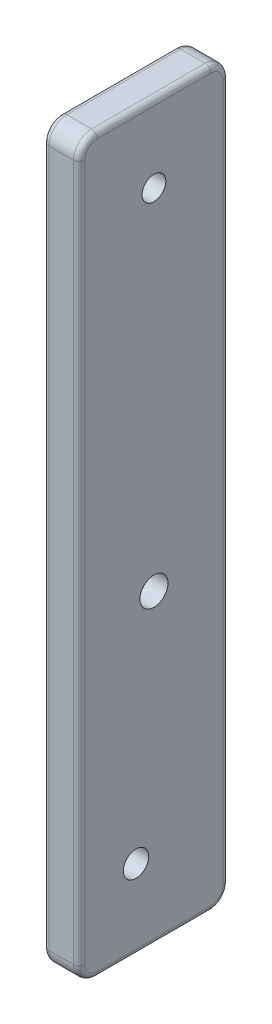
from build123d import *

# Parameters (mm, degrees)
BOSS_EXTRUDE2_DEPTH = 6.35
SKETCH8_R           = 2.25
CUT_EXTRUDE3_DEPTH  = 99.138600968
SKETCH10_R          = 1.55
CUT_EXTRUDE4_DEPTH  = 99.138600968
FILLET2_R           = 3.175
SKETCH11_R          = 2.48125
CUT_EXTRUDE5_DEPTH  = 99.138600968
SKETCH12_R          = 2.250000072
CUT_EXTRUDE6_DEPTH  = 99.138600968
SKETCH13_W          = 6.35
SKETCH13_H          = 20.1
BOSS_EXTRUDE3_DEPTH = 7.62
SKETCH14_W          = 6.35
SKETCH14_H          = 20.1
BOSS_EXTRUDE4_DEPTH = 50.8
SKETCH15_W          = 6.35
SKETCH15_H          = 17.62710482
BOSS_EXTRUDE5_DEPTH = 26.45
FILLET7_R           = 1
SKETCH16_R          = 2.1
CUT_EXTRUDE7_DEPTH  = 99.138600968
SKETCH17_R          = 4.6
CUT_EXTRUDE8_DEPTH  = 1.5875


with BuildPart() as part:
    # Sketch2 → Boss-Extrude2 (new body)
    with BuildSketch(Plane(origin=(0, 0, 0), x_dir=(0, 0, -1), z_dir=(1, 0, 0))):
        Polygon((-10.05, 20.35), (10.05, 20.35), (10.05, -20.35), (-10.05, -20.35), (-10.05, -96.55), (16.4, -96.55), (16.4, 33.05), (-10.05, 33.05), align=None)
    extrude(amount=BOSS_EXTRUDE2_DEPTH)

    # Sketch8 → Cut-Extrude3 (cut, through all)
    with BuildSketch(Plane(origin=(6.35, 0, 0), x_dir=(0, 0, -1), z_dir=(1, 0, 0))):
        with Locations((-4.75, 24.5)):
            Circle(SKETCH8_R)
        with Locations(Location((4.75, 24.5, 0), (0, 0, 180))):
            Circle(SKETCH8_R)
        with Locations((4.75, -24.5)):
            Circle(SKETCH8_R)
        with Locations(Location((-4.75, -24.5, 0), (0, 0, 180))):
            Circle(SKETCH8_R)
    extrude(amount=-CUT_EXTRUDE3_DEPTH, mode=Mode.SUBTRACT)

    # Sketch10 → Cut-Extrude4 (cut, through all)
    with BuildSketch(Plane(origin=(6.35, 0, 0), x_dir=(0, 0, -1), z_dir=(1, 0, 0))):
        with Locations((0, -58.45)):
            Circle(SKETCH10_R)
        with Locations((0, -62.45)):
            Circle(SKETCH10_R)
        with Locations((0, -82.45)):
            Circle(SKETCH10_R)
    extrude(amount=-CUT_EXTRUDE4_DEPTH, mode=Mode.SUBTRACT)

    # Fillet2
    fillet2_edges = [part.edges().sort_by_distance(p)[0] for p in [
        (3.175, 33.05, 10.05),
        (3.175, 33.05, -16.4),
        (3.175, -96.55, -16.4),
        (3.175, -96.55, 10.05),
    ]]
    fillet(fillet2_edges, radius=FILLET2_R)

    # Sketch11 → Cut-Extrude5 (cut, through all)
    with BuildSketch(Plane(origin=(6.35, 0, 0), x_dir=(0, 0, -1), z_dir=(1, 0, 0))):
        with Locations((3.175, -42.287633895)):
            Circle(SKETCH11_R)
    extrude(amount=-CUT_EXTRUDE5_DEPTH, mode=Mode.SUBTRACT)

    # Sketch12 → Cut-Extrude6 (cut, through all)
    with BuildSketch(Plane(origin=(6.35, 0, 0), x_dir=(0, 0, -1), z_dir=(1, 0, 0))):
        with Locations((0, -82.45)):
            Circle(SKETCH12_R)
    extrude(amount=-CUT_EXTRUDE6_DEPTH, mode=Mode.SUBTRACT)

    # Sketch13 → Boss-Extrude3 (add)
    with BuildSketch(Plane.XZ.offset(-20.35)):
        with Locations((3.175, 0)):
            Rectangle(SKETCH13_W, SKETCH13_H)
    extrude(amount=-BOSS_EXTRUDE3_DEPTH)

    # Sketch14 → Boss-Extrude4 (add)
    with BuildSketch(Plane.XZ.offset(-20.35)):
        with Locations((3.175, 0)):
            Rectangle(SKETCH14_W, SKETCH14_H)
    extrude(amount=BOSS_EXTRUDE4_DEPTH)

    # Sketch15 → Boss-Extrude5 (add)
    with BuildSketch(Plane.XY.offset(10.05)):
        with Locations((3.175, -61.162548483)):
            Rectangle(SKETCH15_W, SKETCH15_H)
    extrude(amount=-BOSS_EXTRUDE5_DEPTH)

    # Fillet7
    fillet7_edges = [part.edges().sort_by_distance(p)[0] for p in [
        (0, -31.75, 10.05),
        (6.35, -31.75, 10.05),
        (0, 33.05, -3.175),
        (6.35, 33.05, -3.175),
        (0, -31.75, -16.4),
        (0, -96.55, -3.175),
        (0, 32.12006403, 9.12006403),
        (0, -95.62006403, 9.12006403),
        (0, -95.62006403, -15.47006403),
        (0, 32.12006403, -15.47006403),
        (6.35, -31.75, -16.4),
        (6.35, -96.55, -3.175),
        (6.35, 32.12006403, 9.12006403),
        (6.35, -95.62006403, 9.12006403),
        (6.35, -95.62006403, -15.47006403),
        (6.35, 32.12006403, -15.47006403),
    ]]
    fillet(fillet7_edges, radius=FILLET7_R)

    # Sketch16 → Cut-Extrude7 (cut, through all)
    with BuildSketch(Plane(origin=(6.35, 0, 0), x_dir=(0, 0, -1), z_dir=(1, 0, 0))):
        with Locations((3.175, 19.48)):
            Circle(SKETCH16_R)
    extrude(amount=-CUT_EXTRUDE7_DEPTH, mode=Mode.SUBTRACT)

    # Sketch17 → Cut-Extrude8 (cut)
    with BuildSketch(Plane.ZY):
        with Locations((0, -82.45)):
            Circle(SKETCH17_R)
    extrude(amount=-CUT_EXTRUDE8_DEPTH, mode=Mode.SUBTRACT)


solid = part.part
